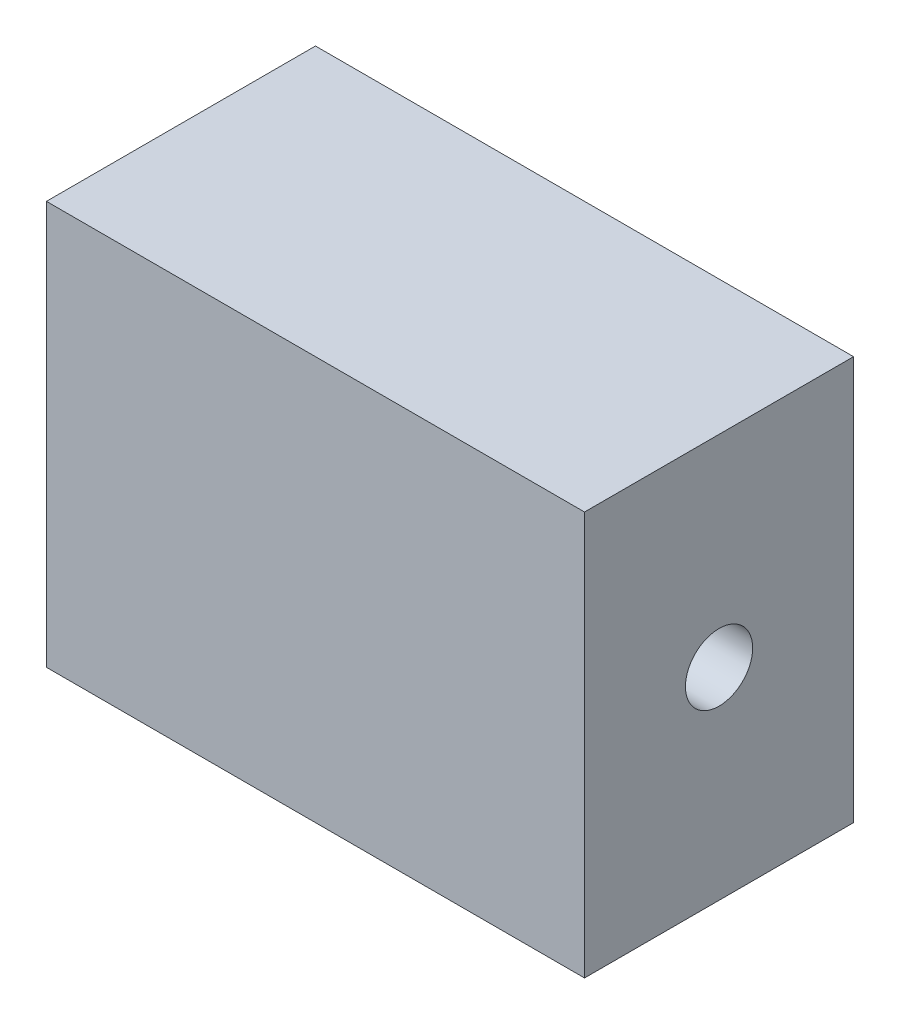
from build123d import *

# Parameters (mm, degrees)
SKETCH1_W           = 40
SKETCH1_H           = 30
BOSS_EXTRUDE1_DEPTH = 20
SKETCH2_R           = 2.5
CUT_EXTRUDE1_DEPTH  = 20


with BuildPart() as part:
    # Sketch1 → Boss-Extrude1 (new body)
    with BuildSketch(Plane.XY):
        with Locations((20, 15)):
            Rectangle(SKETCH1_W, SKETCH1_H)
    extrude(amount=BOSS_EXTRUDE1_DEPTH)

    # Sketch2 → Cut-Extrude1 (cut)
    with BuildSketch(Plane(origin=(40, 0, 0), x_dir=(0, 0, -1), z_dir=(1, 0, 0))):
        with Locations((-10, 15)):
            Circle(SKETCH2_R)
    extrude(amount=-CUT_EXTRUDE1_DEPTH, mode=Mode.SUBTRACT)


solid = part.part
